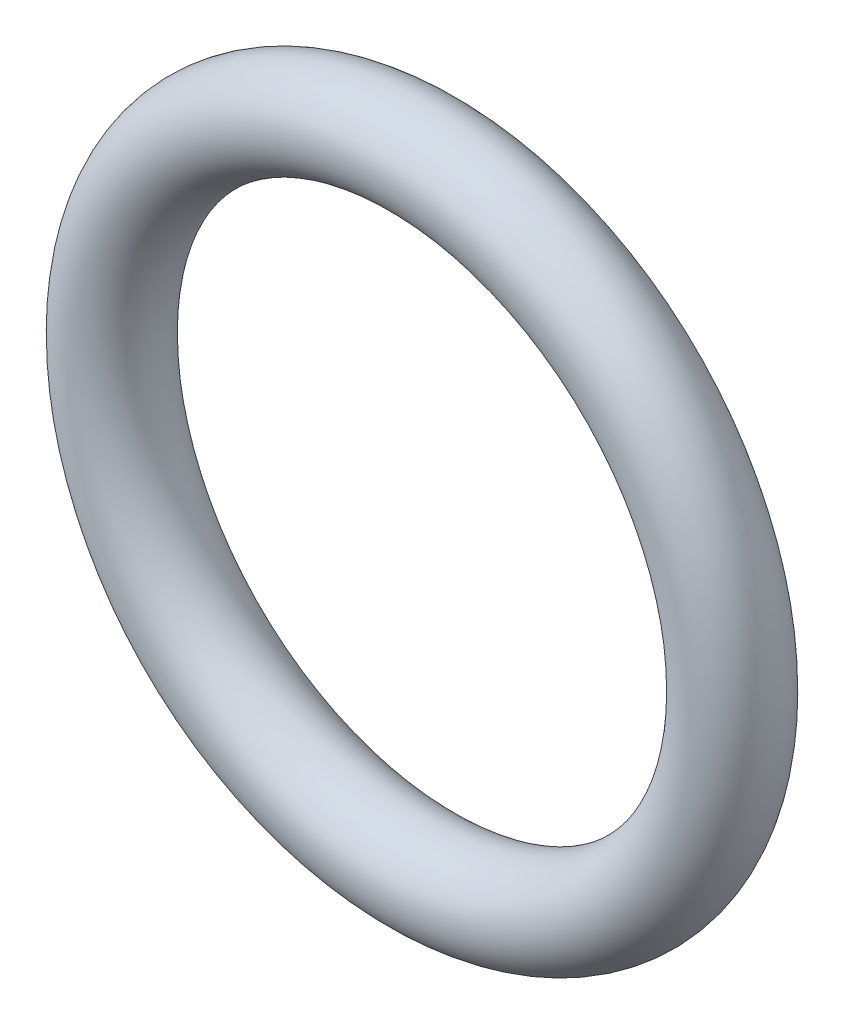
ISO-10303-21;
HEADER;
FILE_DESCRIPTION(('STEP AP214'),'2;1');
FILE_NAME('part.step','',(''),(''),'','','');
FILE_SCHEMA(('AUTOMOTIVE_DESIGN { 1 0 10303 214 1 1 1 1 }'));
ENDSEC;
DATA;
#1=APPLICATION_CONTEXT('core data for automotive mechanical design processes');
#2=APPLICATION_PROTOCOL_DEFINITION('international standard','automotive_design',2000,#1);
#3=PRODUCT_CONTEXT('',#1,'mechanical');
#4=PRODUCT('Part','Part','',(#3));
#5=PRODUCT_RELATED_PRODUCT_CATEGORY('part','',(#4));
#6=PRODUCT_DEFINITION_FORMATION('','',#4);
#7=PRODUCT_DEFINITION_CONTEXT('part definition',#1,'design');
#8=PRODUCT_DEFINITION('design','',#6,#7);
#9=PRODUCT_DEFINITION_SHAPE('','',#8);
#10=(LENGTH_UNIT() NAMED_UNIT(*) SI_UNIT(.MILLI.,.METRE.));
#11=(NAMED_UNIT(*) PLANE_ANGLE_UNIT() SI_UNIT($,.RADIAN.));
#12=(NAMED_UNIT(*) SI_UNIT($,.STERADIAN.) SOLID_ANGLE_UNIT());
#13=UNCERTAINTY_MEASURE_WITH_UNIT(LENGTH_MEASURE(1.E-05),#10,'distance_accuracy_value','');
#14=(GEOMETRIC_REPRESENTATION_CONTEXT(3) GLOBAL_UNCERTAINTY_ASSIGNED_CONTEXT((#13)) GLOBAL_UNIT_ASSIGNED_CONTEXT((#10,
#11,#12)) REPRESENTATION_CONTEXT('',''));
#15=CARTESIAN_POINT('',(0.,0.,0.));
#16=DIRECTION('',(0.,0.,1.));
#17=DIRECTION('',(1.,0.,0.));
#18=AXIS2_PLACEMENT_3D('',#15,#16,#17);
#19=CARTESIAN_POINT('',(0.,0.,0.));
#20=DIRECTION('',(0.,0.,1.));
#21=DIRECTION('',(1.,0.,0.));
#22=AXIS2_PLACEMENT_3D('',#19,#20,#21);
#23=TOROIDAL_SURFACE('',#22,5.35,0.800000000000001);
#24=CARTESIAN_POINT('',(6.15,0.,0.));
#25=VERTEX_POINT('',#24);
#26=VERTEX_LOOP('',#25);
#27=FACE_BOUND('',#26,.T.);
#28=ADVANCED_FACE('F28',(#27),#23,.T.);
#29=CLOSED_SHELL('',(#28));
#30=MANIFOLD_SOLID_BREP('B2',#29);
#31=ADVANCED_BREP_SHAPE_REPRESENTATION('',(#18,#30),#14);
#32=SHAPE_DEFINITION_REPRESENTATION(#9,#31);
ENDSEC;
END-ISO-10303-21;
